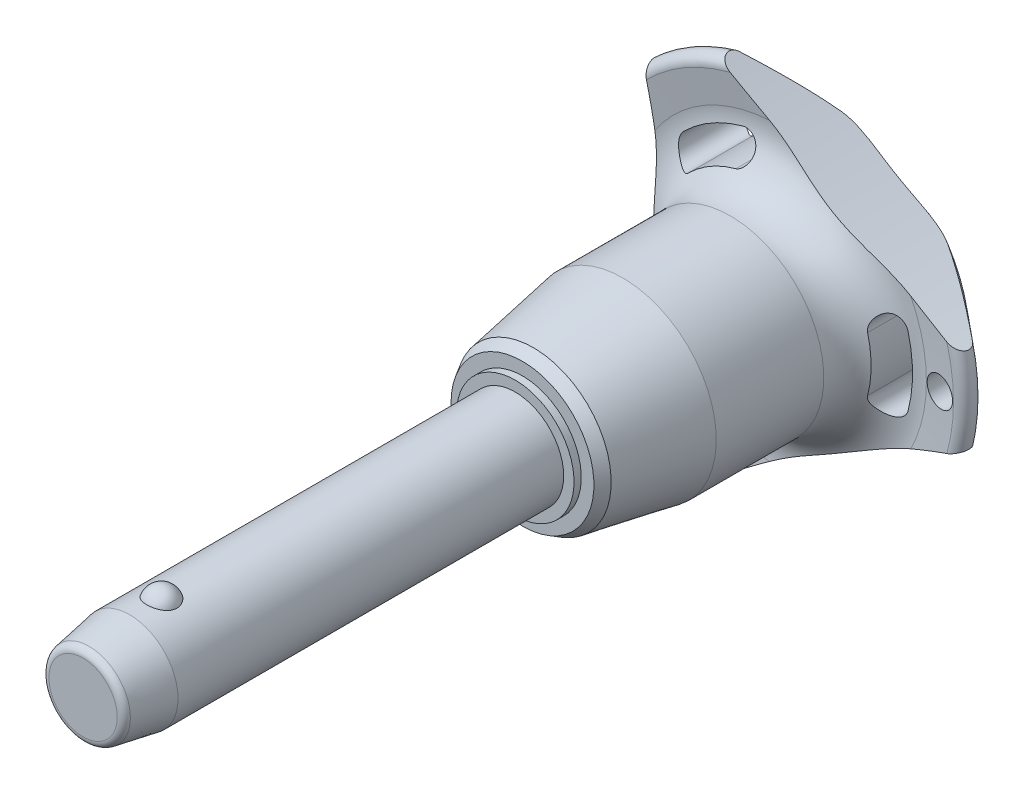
from build123d import *

# Parameters (mm, degrees)
SKETCH1_R           = 5
BOSS_EXTRUDE1_DEPTH = 35
SKETCH2_R           = 4.25
BOSS_EXTRUDE2_DEPTH = 33.3
BOSS_EXTRUDE3_START = 9.6
SKETCH1_2_R         = 5
BOSS_EXTRUDE3_DEPTH = 9.6
CHAMFER1_SIZE       = 4.8
CHAMFER1_SIZE2      = 0.846369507
FILLET1_R           = 0.75
SKETCH6_R           = 102.8
CUT_EXTRUDE1_DEPTH  = 74.713650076
CIRPATTERN1_COUNT   = 3
SKETCH7_R           = 1.5
CUT_EXTRUDE2_DEPTH  = 74.493908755


with BuildPart() as part:
    # Sketch1 → Boss-Extrude1 (new body)
    with BuildSketch(Plane.XY):
        Circle(SKETCH1_R)
    extrude(amount=-BOSS_EXTRUDE1_DEPTH)

    # Sketch2 → Boss-Extrude2 (add)
    with BuildSketch(Plane(origin=(0, 0, -35), x_dir=(-1, 0, 0), z_dir=(0, 0, -1))):
        Circle(SKETCH2_R)
    extrude(amount=BOSS_EXTRUDE2_DEPTH)

    # Sketch3 → Revolve1 (revolve)
    with BuildSketch(Plane(origin=(0, 0, 0), x_dir=(0, 0, -1), z_dir=(1, 0, 0))):
        with BuildLine():
            Line((-1.516575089, 6), (-1.516575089, 2.7))
            ThreePointArc((-1.516575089, 2.7), (0.133424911, 4.35), (-1.516575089, 6))
        make_face()
        with BuildLine():
            Line((-1.516575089, -2.7), (-1.516575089, -6))
            ThreePointArc((-1.516575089, -6), (0.133424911, -4.35), (-1.516575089, -2.7))
        make_face()
    revolve(axis=Axis((0, -2.7, 1.516575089), (0, 1, 0)))

    # Sketch1_2 → Boss-Extrude3 (add)
    with BuildSketch(Plane.XY.offset(BOSS_EXTRUDE3_START)):
        Circle(SKETCH1_2_R)
    extrude(amount=-BOSS_EXTRUDE3_DEPTH)

    # Chamfer1
    chamfer1_edges = [part.edges().sort_by_distance(p)[0] for p in [
        (-5, 0, 9.6),
    ]]
    chamfer1_side = [part.faces().sort_by_distance(p)[0] for p in [
        (-5, 0, -12.7),
    ]]
    chamfer(chamfer1_edges, length=CHAMFER1_SIZE, length2=CHAMFER1_SIZE2, reference=chamfer1_side[0])

    # Fillet1
    fillet1_edges = [part.edges().sort_by_distance(p)[0] for p in [
        (-4.153630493, 0, 9.6),
        (4.25, 0, -68.3),
    ]]
    fillet(fillet1_edges, radius=FILLET1_R)

    # Sketch4 → Revolve2 (revolve)
    with BuildSketch(Plane(origin=(0, 0, 0), x_dir=(0, 0, -1), z_dir=(1, 0, 0)), mode=Mode.PRIVATE) as revolve2_sk:
        Polygon((35, 0), (35, 6.067402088), (35.75, 6.067402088), (35.75, 7.371950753), (36.879772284, 8.024225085), (46.1, 9.65), (57.2, 9.65), (57.2, 0), align=None)
    revolve(revolve2_sk.sketch.rotate(Axis((0, 0, -57.2), (0, 0, 1)), 90), axis=Axis((0, 0, -57.2), (0, 0, 1)))

    # Sketch5 → Revolve3 (revolve)
    with BuildSketch(Plane(origin=(0, 0, 0), x_dir=(0, 0, -1), z_dir=(1, 0, 0)), mode=Mode.PRIVATE) as revolve3_sk:
        with BuildLine():
            Line((62.16082631, 15.274661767), (61.757834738, 18.475067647))
            ThreePointArc((61.757834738, 18.475067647), (62.349836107, 19.516443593), (63.516044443, 19.24278761))
            Line((63.516044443, 19.24278761), (67.835691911, 14.094832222))
            ThreePointArc((67.835691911, 14.094832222), (68.3, 12.689260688), (67.67067517, 11.349423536))
            ThreePointArc((67.67067517, 11.349423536), (64.033110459, 6.185112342), (62.75, 0))
            Line((62.75, 0), (57.2, 0))
            Line((57.2, 0), (57.2, 9.65))
            ThreePointArc((57.2, 9.65), (60.949887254, 11.342683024), (62.16082631, 15.274661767))
        make_face()
    revolve(revolve3_sk.sketch.rotate(Axis((0, 0, -62.75), (0, 0, 1)), 90), axis=Axis((0, 0, -62.75), (0, 0, 1)))

    # Sketch6 → Cut-Extrude1 (cut, through all)
    with BuildSketch(Plane.XY):
        with Locations((-115.2, 0)):
            Circle(SKETCH6_R)
        with BuildLine():
            ThreePointArc((13.411913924, -3.529271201), (13.868496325, 0), (13.411913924, 3.529271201))
            ThreePointArc((13.411913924, 3.529271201), (11.694200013, 4.531299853), (10.692171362, 2.813585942))
            ThreePointArc((10.692171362, 2.813585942), (11.056165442, 0), (10.692171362, -2.813585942))
            ThreePointArc((10.692171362, -2.813585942), (11.694200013, -4.531299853), (13.411913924, -3.529271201))
        make_face()
    cut_extrude1 = extrude(amount=-CUT_EXTRUDE1_DEPTH, mode=Mode.SUBTRACT)

    # CirPattern1: Cut-Extrude1 ×3 about axis
    cirpattern1_axis = Axis((0, 0, 0), (0, 0, 1))
    for i in range(1, CIRPATTERN1_COUNT):
        add(cut_extrude1.rotate(cirpattern1_axis, i * 360 / CIRPATTERN1_COUNT), mode=Mode.SUBTRACT)

    # Sketch7 → Cut-Extrude2 (cut, through all)
    with BuildSketch(Plane.XY):
        with Locations(Location((16.868496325, 0, 0), (0, 0, 225.467095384))):
            Circle(SKETCH7_R)
    extrude(amount=-CUT_EXTRUDE2_DEPTH, mode=Mode.SUBTRACT)


solid = part.part
